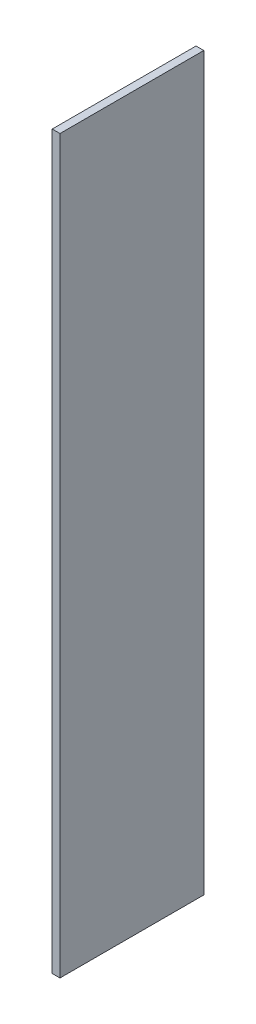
from build123d import *

# Parameters (mm, degrees)
SKETCH1_W           = 56.4388
SKETCH1_H           = 287.02
BOSS_EXTRUDE1_DEPTH = 3.048


with BuildPart() as part:
    # Sketch1 → Boss-Extrude1 (new body)
    with BuildSketch(Plane(origin=(0, 0, 0), x_dir=(0, 0, -1), z_dir=(1, 0, 0))):
        Rectangle(SKETCH1_W, SKETCH1_H)
    extrude(amount=BOSS_EXTRUDE1_DEPTH)


solid = part.part
